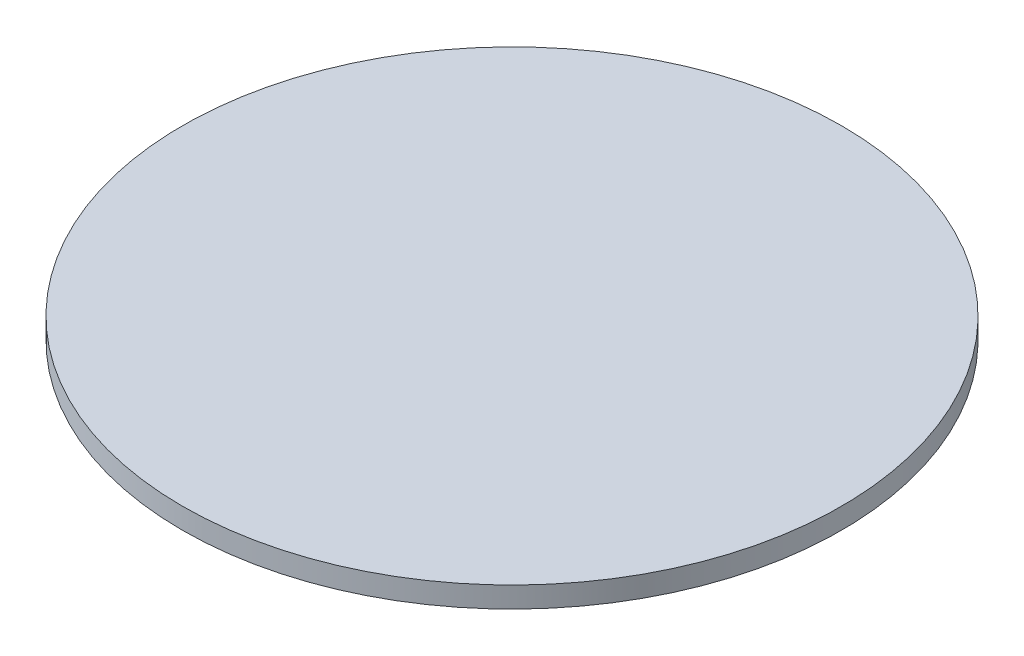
from build123d import *

# Parameters (mm, degrees)
SKETCH1_R           = 100.33
BOSS_EXTRUDE1_DEPTH = 6.35


with BuildPart() as part:
    # Sketch1 → Boss-Extrude1 (new body)
    with BuildSketch(Plane(origin=(0, 0, 0), x_dir=(1, 0, 0), z_dir=(0, 1, 0))):
        with Locations(Location((0, 0, 0), (0, 0, 270))):
            Circle(SKETCH1_R)
    extrude(amount=BOSS_EXTRUDE1_DEPTH)


solid = part.part
